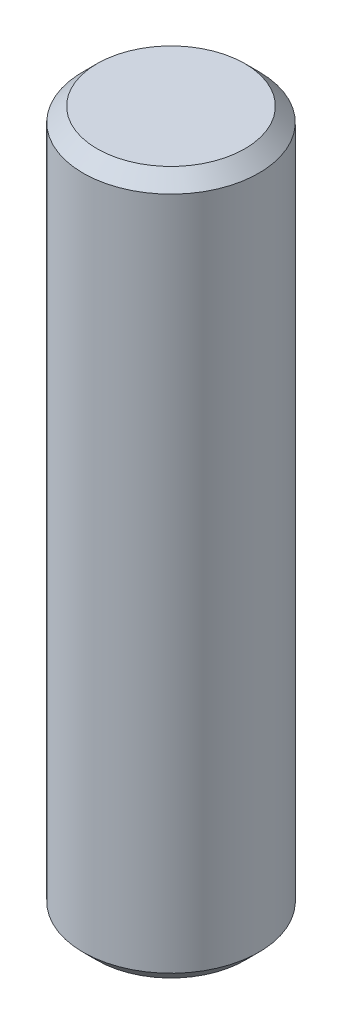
from build123d import *

# Parameters (mm, degrees)
SKETCH1_R      = 4.76504
EXTRUDE1_DEPTH = 19.05
CHAMFER1_SIZE  = 0.762


with BuildPart() as part:
    # Sketch1 → Extrude1 (new, symmetric)
    with BuildSketch(Plane(origin=(0, 0, 0), x_dir=(1, 0, 0), z_dir=(0, 1, 0))):
        with Locations(Location((0, 0, 0), (0, 0, 90))):
            Circle(SKETCH1_R)
    extrude(amount=EXTRUDE1_DEPTH, both=True)

    # Chamfer1
    chamfer1_edges = [part.edges().sort_by_distance(p)[0] for p in [
        (0, -19.05, 4.76504),
        (0, 19.05, 4.76504),
    ]]
    chamfer(chamfer1_edges, length=CHAMFER1_SIZE)


solid = part.part
